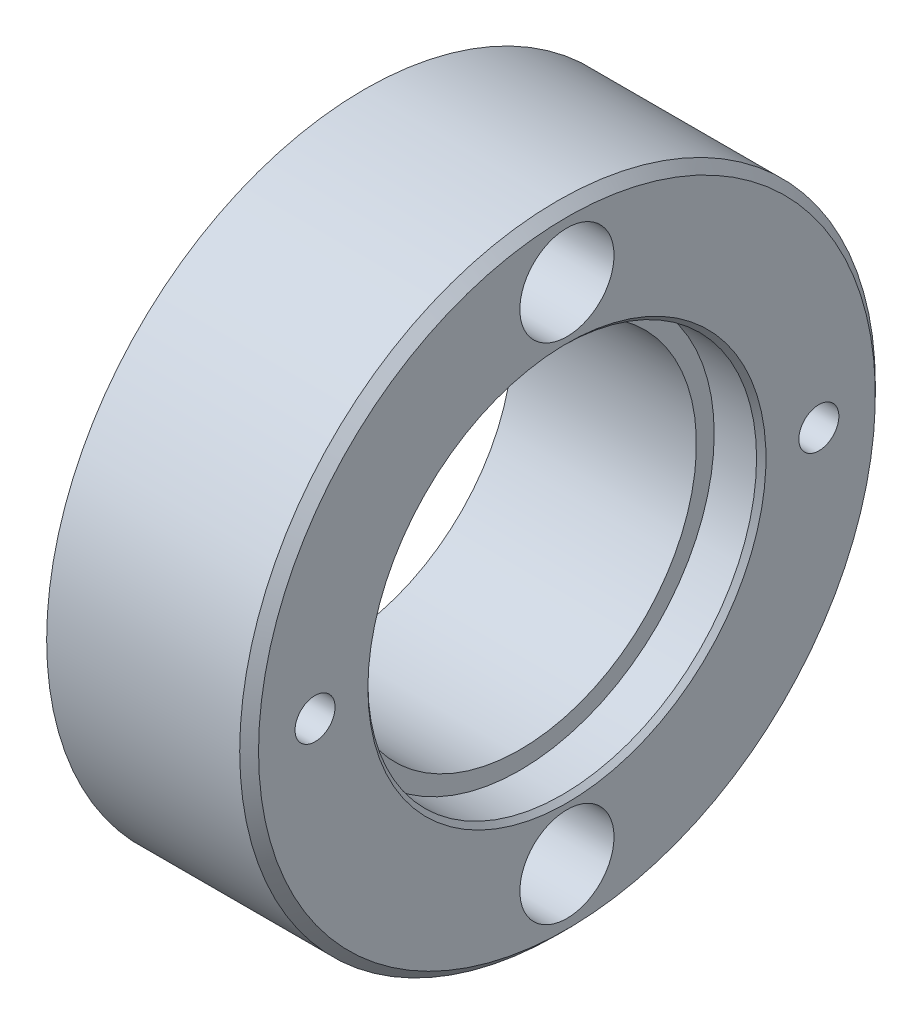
from build123d import *

# Parameters (mm, degrees)
CHAMBRAGE_POUR_VIS_T_TE_HEXAGONALE_M10_D           = 11
CHAMBRAGE_POUR_VIS_T_TE_HEXAGONALE_M10_CBORE_D     = 20
CHAMBRAGE_POUR_VIS_T_TE_HEXAGONALE_M10_CBORE_DEPTH = 20
R_P_TITION_CIRCULAIRE1_COUNT                       = 2


with BuildPart() as part:
    # Esquisse1 → R_volution1 (revolve)
    with BuildSketch(Plane.XY, mode=Mode.PRIVATE) as r_volution1_sk:
        Polygon((0, 37.5), (39, 37.5), (39, 41.275), (48, 41.275), (49, 42.275), (49, 65.5), (47, 67.5), (6, 67.5), (6, 41.275), (1, 41.275), (0, 40.275), align=None)
    revolve(r_volution1_sk.sketch.rotate(Axis((0, 0, 0), (1, 0, 0)), 90), axis=Axis((0, 0, 0), (1, 0, 0)))

    # Esquisse3 → Trou taraud_ M101 (revolve, cut)
    with BuildSketch(Plane(origin=(49, 0, 53.5), x_dir=(0, 0, -1), z_dir=(0, 1, 0))):
        Polygon((0, 0), (0, 32.553657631), (4.25, 30), (4.25, 0), align=None)
    trou_taraud_m101 = revolve(axis=Axis((55.35, 0, 53.5), (-1, 0, 0)), mode=Mode.SUBTRACT)

    # Chambrage pour vis _ t_te hexagonale M10 (through all)
    with Locations(Plane(origin=(49, 0, 0), x_dir=(0, 0, -1), z_dir=(1, 0, 0))):
        with Locations((0, 53.5)):
            chambrage_pour_vis_t_te_hexagonale_m10 = CounterBoreHole(CHAMBRAGE_POUR_VIS_T_TE_HEXAGONALE_M10_D / 2, CHAMBRAGE_POUR_VIS_T_TE_HEXAGONALE_M10_CBORE_D / 2, CHAMBRAGE_POUR_VIS_T_TE_HEXAGONALE_M10_CBORE_DEPTH)

    # R_p_tition circulaire1: Trou taraud_ M101, Chambrage pour vis _ t_te hexagonale M10 ×2 about axis
    r_p_tition_circulaire1_axis = Axis((0, 0, 0), (1, 0, 0))
    add([trou_taraud_m101.rotate(r_p_tition_circulaire1_axis, i * 360 / R_P_TITION_CIRCULAIRE1_COUNT) for i in range(1, R_P_TITION_CIRCULAIRE1_COUNT)], mode=Mode.SUBTRACT)
    add([chambrage_pour_vis_t_te_hexagonale_m10.rotate(r_p_tition_circulaire1_axis, i * 360 / R_P_TITION_CIRCULAIRE1_COUNT) for i in range(1, R_P_TITION_CIRCULAIRE1_COUNT)], mode=Mode.SUBTRACT)


solid = part.part
